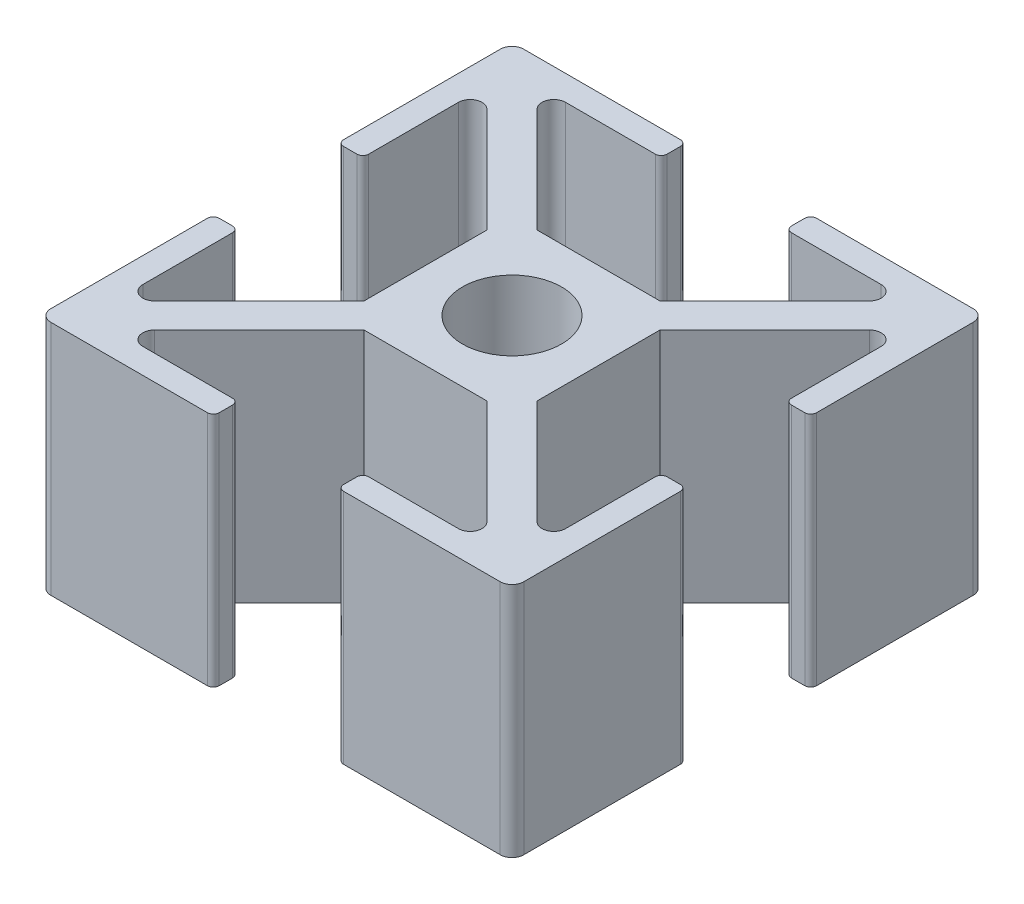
from build123d import *

# Parameters (mm, degrees)
BOSS_EXTRUDE1_DEPTH      = 10
FILLET1_R                = 0.5
FILLET2_R                = 0.25
CIRPATTERN1_COUNT        = 4
FILLET1_OF_CIRPATTERN1_R = 0.5
FILLET2_OF_CIRPATTERN1_R = 0.25


with BuildPart() as part:
    # Sketch2 → Boss-Extrude1 (new body)
    with BuildSketch(Plane(origin=(0, 0, 0), x_dir=(1, 0, 0), z_dir=(0, 1, 0))):
        Polygon((10, 8.939339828), (8.939339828, 7.878679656), (8.939339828, 2.63), (10, 2.63), align=None)
        Polygon((5.995, 7.055660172), (2.599339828, 3.66), (3.66, 3.66), (3.66, 2.599339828), (8.939339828, 7.878679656), (8.939339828, 8.939339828), (7.878679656, 8.939339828), align=None)
        Polygon((8.939339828, 10), (7.878679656, 8.939339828), (8.939339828, 8.939339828), align=None)
        Polygon((10, 8.939339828), (8.939339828, 10), (8.939339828, 8.939339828), align=None)
        Polygon((10, 10), (8.939339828, 10), (10, 8.939339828), align=None)
        Polygon((8.939339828, 8.939339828), (8.939339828, 7.878679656), (10, 8.939339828), align=None)
        Polygon((5.995, 8.939339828), (7.878679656, 8.939339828), (8.939339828, 10), (2.63, 10), (2.63, 8.939339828), align=None)
        with BuildLine():
            Line((2.599339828, 3.66), (0.852877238, 1.913537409))
            ThreePointArc((0.852877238, 1.913537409), (1.481388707, 1.481388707), (1.913537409, 0.852877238))
            Line((1.913537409, 0.852877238), (3.66, 2.599339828))
            Line((3.66, 2.599339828), (3.66, 3.66))
            Line((3.66, 3.66), (2.599339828, 3.66))
        make_face()
        with BuildLine():
            Line((-0.852877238, -1.913537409), (-2.599339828, -3.66))
            Line((-2.599339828, -3.66), (3.66, -3.66))
            Line((3.66, -3.66), (3.66, 2.599339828))
            Line((3.66, 2.599339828), (1.913537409, 0.852877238))
            ThreePointArc((1.913537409, 0.852877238), (2.04913224, 0.435984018), (2.095, 0))
            ThreePointArc((2.095, 0), (1.140668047, -1.757242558), (-0.852877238, -1.913537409))
        make_face()
        with BuildLine():
            Line((-3.66, 3.66), (-3.66, -2.599339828))
            Line((-3.66, -2.599339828), (-1.913537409, -0.852877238))
            ThreePointArc((-1.913537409, -0.852877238), (-1.481388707, 1.481388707), (0.852877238, 1.913537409))
            Line((0.852877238, 1.913537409), (2.599339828, 3.66))
            Line((2.599339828, 3.66), (-3.66, 3.66))
        make_face()
        with BuildLine():
            Line((-1.913537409, -0.852877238), (-3.66, -2.599339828))
            Line((-3.66, -2.599339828), (-3.66, -3.66))
            Line((-3.66, -3.66), (-2.599339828, -3.66))
            Line((-2.599339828, -3.66), (-0.852877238, -1.913537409))
            ThreePointArc((-0.852877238, -1.913537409), (-1.481388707, -1.481388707), (-1.913537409, -0.852877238))
        make_face()
    boss_extrude1 = extrude(amount=BOSS_EXTRUDE1_DEPTH)

    # Fillet1
    fillet1_edges = [part.edges().sort_by_distance(p)[0] for p in [
        (8.939339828, 5, -7.878679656),
        (7.878679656, 5, -8.939339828),
        (10, 5, -10),
    ]]
    fillet(fillet1_edges, radius=FILLET1_R)

    # Fillet2
    fillet2_edges = [part.edges().sort_by_distance(p)[0] for p in [
        (10, 5, -2.63),
        (8.939339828, 5, -2.63),
        (2.63, 5, -8.939339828),
        (2.63, 5, -10),
    ]]
    fillet(fillet2_edges, radius=FILLET2_R)

    # CirPattern1: Boss-Extrude1 ×4 about axis
    cirpattern1_axis = Axis((0, 0, 0), (0, 1, 0))
    for i in range(1, CIRPATTERN1_COUNT):
        add(boss_extrude1.rotate(cirpattern1_axis, i * 360 / CIRPATTERN1_COUNT))

    # Fillet1 of CirPattern1
    fillet1_of_cirpattern1_edges = [part.edges().sort_by_distance(p)[0] for p in [
        (-7.878679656, 5, -8.939339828),
        (-8.939339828, 5, -7.878679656),
        (-10, 5, -10),
        (-8.939339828, 5, 7.878679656),
        (-7.878679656, 5, 8.939339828),
        (-10, 5, 10),
        (7.878679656, 5, 8.939339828),
        (8.939339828, 5, 7.878679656),
        (10, 5, 10),
    ]]
    fillet(fillet1_of_cirpattern1_edges, radius=FILLET1_OF_CIRPATTERN1_R)

    # Fillet2 of CirPattern1
    fillet2_of_cirpattern1_edges = [part.edges().sort_by_distance(p)[0] for p in [
        (-2.63, 5, -10),
        (-2.63, 5, -8.939339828),
        (-8.939339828, 5, -2.63),
        (-10, 5, -2.63),
        (-10, 5, 2.63),
        (-8.939339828, 5, 2.63),
        (-2.63, 5, 8.939339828),
        (-2.63, 5, 10),
        (2.63, 5, 10),
        (2.63, 5, 8.939339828),
        (8.939339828, 5, 2.63),
        (10, 5, 2.63),
    ]]
    fillet(fillet2_of_cirpattern1_edges, radius=FILLET2_OF_CIRPATTERN1_R)


solid = part.part
